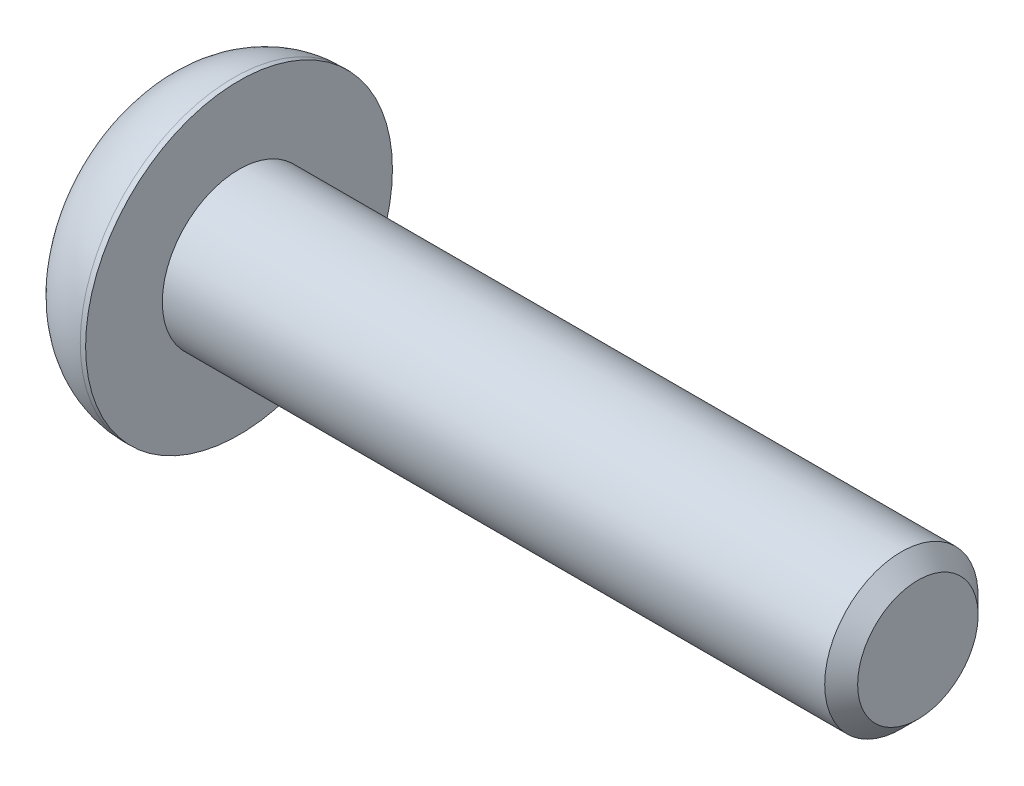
ISO-10303-21;
HEADER;
FILE_DESCRIPTION(('STEP AP214'),'2;1');
FILE_NAME('part.step','',(''),(''),'','','');
FILE_SCHEMA(('AUTOMOTIVE_DESIGN { 1 0 10303 214 1 1 1 1 }'));
ENDSEC;
DATA;
#1=APPLICATION_CONTEXT('core data for automotive mechanical design processes');
#2=APPLICATION_PROTOCOL_DEFINITION('international standard','automotive_design',2000,#1);
#3=PRODUCT_CONTEXT('',#1,'mechanical');
#4=PRODUCT('Part','Part','',(#3));
#5=PRODUCT_RELATED_PRODUCT_CATEGORY('part','',(#4));
#6=PRODUCT_DEFINITION_FORMATION('','',#4);
#7=PRODUCT_DEFINITION_CONTEXT('part definition',#1,'design');
#8=PRODUCT_DEFINITION('design','',#6,#7);
#9=PRODUCT_DEFINITION_SHAPE('','',#8);
#10=(LENGTH_UNIT() NAMED_UNIT(*) SI_UNIT(.MILLI.,.METRE.));
#11=(NAMED_UNIT(*) PLANE_ANGLE_UNIT() SI_UNIT($,.RADIAN.));
#12=(NAMED_UNIT(*) SI_UNIT($,.STERADIAN.) SOLID_ANGLE_UNIT());
#13=UNCERTAINTY_MEASURE_WITH_UNIT(LENGTH_MEASURE(1.E-05),#10,'distance_accuracy_value','');
#14=(GEOMETRIC_REPRESENTATION_CONTEXT(3) GLOBAL_UNCERTAINTY_ASSIGNED_CONTEXT((#13)) GLOBAL_UNIT_ASSIGNED_CONTEXT((#10,
#11,#12)) REPRESENTATION_CONTEXT('',''));
#15=CARTESIAN_POINT('',(0.,0.,0.));
#16=DIRECTION('',(0.,0.,1.));
#17=DIRECTION('',(1.,0.,0.));
#18=AXIS2_PLACEMENT_3D('',#15,#16,#17);
#19=CARTESIAN_POINT('',(1.495,0.721687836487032,1.25));
#20=DIRECTION('',(1.,0.,0.));
#21=DIRECTION('',(0.,0.,-1.));
#22=AXIS2_PLACEMENT_3D('',#19,#20,#21);
#23=PLANE('',#22);
#24=CARTESIAN_POINT('',(1.495,0.,0.));
#25=DIRECTION('',(1.,0.,0.));
#26=DIRECTION('',(0.,0.,-1.));
#27=AXIS2_PLACEMENT_3D('',#24,#25,#26);
#28=CIRCLE('',#27,1.25);
#29=CARTESIAN_POINT('',(1.495,0.,-1.25));
#30=VERTEX_POINT('',#29);
#31=CARTESIAN_POINT('',(1.495,-1.08253175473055,-0.625));
#32=VERTEX_POINT('',#31);
#33=EDGE_CURVE('E11',#30,#32,#28,.F.);
#34=ORIENTED_EDGE('',*,*,#33,.F.);
#35=DIRECTION('',(0.,1.,0.));
#36=VECTOR('',#35,1.);
#37=CARTESIAN_POINT('',(1.495,-0.721687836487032,-1.25));
#38=LINE('',#37,#36);
#39=CARTESIAN_POINT('',(1.495,-0.721687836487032,-1.25));
#40=VERTEX_POINT('',#39);
#41=EDGE_CURVE('E155',#40,#30,#38,.T.);
#42=ORIENTED_EDGE('',*,*,#41,.F.);
#43=DIRECTION('',(0.,0.5,-0.866025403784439));
#44=VECTOR('',#43,1.);
#45=CARTESIAN_POINT('',(1.495,-1.44337567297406,0.));
#46=LINE('',#45,#44);
#47=EDGE_CURVE('E407',#32,#40,#46,.T.);
#48=ORIENTED_EDGE('',*,*,#47,.F.);
#49=EDGE_LOOP('',(#34,#42,#48));
#50=FACE_BOUND('',#49,.T.);
#51=ADVANCED_FACE('F32',(#50),#23,.F.);
#52=CARTESIAN_POINT('',(1.495,-1.08253175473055,0.625));
#53=VERTEX_POINT('',#52);
#54=EDGE_CURVE('E41',#32,#53,#28,.F.);
#55=ORIENTED_EDGE('',*,*,#54,.F.);
#56=CARTESIAN_POINT('',(1.495,-1.44337567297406,0.));
#57=VERTEX_POINT('',#56);
#58=EDGE_CURVE('E408',#57,#32,#46,.T.);
#59=ORIENTED_EDGE('',*,*,#58,.F.);
#60=DIRECTION('',(0.,-0.5,-0.866025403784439));
#61=VECTOR('',#60,1.);
#62=CARTESIAN_POINT('',(1.495,-0.721687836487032,1.25));
#63=LINE('',#62,#61);
#64=EDGE_CURVE('E403',#53,#57,#63,.T.);
#65=ORIENTED_EDGE('',*,*,#64,.F.);
#66=EDGE_LOOP('',(#55,#59,#65));
#67=FACE_BOUND('',#66,.T.);
#68=ADVANCED_FACE('F117',(#67),#23,.F.);
#69=CARTESIAN_POINT('',(1.495,0.,1.25));
#70=VERTEX_POINT('',#69);
#71=EDGE_CURVE('E393',#53,#70,#28,.F.);
#72=ORIENTED_EDGE('',*,*,#71,.F.);
#73=CARTESIAN_POINT('',(1.495,-0.721687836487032,1.25));
#74=VERTEX_POINT('',#73);
#75=EDGE_CURVE('E399',#74,#53,#63,.T.);
#76=ORIENTED_EDGE('',*,*,#75,.F.);
#77=DIRECTION('',(0.,-1.,0.));
#78=VECTOR('',#77,1.);
#79=CARTESIAN_POINT('',(1.495,0.721687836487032,1.25));
#80=LINE('',#79,#78);
#81=EDGE_CURVE('E396',#70,#74,#80,.T.);
#82=ORIENTED_EDGE('',*,*,#81,.F.);
#83=EDGE_LOOP('',(#72,#76,#82));
#84=FACE_BOUND('',#83,.T.);
#85=ADVANCED_FACE('F124',(#84),#23,.F.);
#86=CARTESIAN_POINT('',(1.495,1.08253175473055,0.625));
#87=VERTEX_POINT('',#86);
#88=EDGE_CURVE('E388',#70,#87,#28,.F.);
#89=ORIENTED_EDGE('',*,*,#88,.F.);
#90=CARTESIAN_POINT('',(1.495,0.721687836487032,1.25));
#91=VERTEX_POINT('',#90);
#92=EDGE_CURVE('E391',#91,#70,#80,.T.);
#93=ORIENTED_EDGE('',*,*,#92,.F.);
#94=DIRECTION('',(0.,-0.5,0.866025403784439));
#95=VECTOR('',#94,1.);
#96=CARTESIAN_POINT('',(1.495,1.44337567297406,0.));
#97=LINE('',#96,#95);
#98=EDGE_CURVE('E176',#87,#91,#97,.T.);
#99=ORIENTED_EDGE('',*,*,#98,.F.);
#100=EDGE_LOOP('',(#89,#93,#99));
#101=FACE_BOUND('',#100,.T.);
#102=ADVANCED_FACE('F137',(#101),#23,.F.);
#103=CARTESIAN_POINT('',(1.495,1.08253175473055,-0.625));
#104=VERTEX_POINT('',#103);
#105=EDGE_CURVE('E48',#87,#104,#28,.F.);
#106=ORIENTED_EDGE('',*,*,#105,.F.);
#107=CARTESIAN_POINT('',(1.495,1.44337567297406,0.));
#108=VERTEX_POINT('',#107);
#109=EDGE_CURVE('E151',#108,#87,#97,.T.);
#110=ORIENTED_EDGE('',*,*,#109,.F.);
#111=DIRECTION('',(0.,0.5,0.866025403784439));
#112=VECTOR('',#111,1.);
#113=CARTESIAN_POINT('',(1.495,0.721687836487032,-1.25));
#114=LINE('',#113,#112);
#115=EDGE_CURVE('E148',#104,#108,#114,.T.);
#116=ORIENTED_EDGE('',*,*,#115,.F.);
#117=EDGE_LOOP('',(#106,#110,#116));
#118=FACE_BOUND('',#117,.T.);
#119=ADVANCED_FACE('F129',(#118),#23,.F.);
#120=EDGE_CURVE('E36',#104,#30,#28,.F.);
#121=ORIENTED_EDGE('',*,*,#120,.F.);
#122=CARTESIAN_POINT('',(1.495,0.721687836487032,-1.25));
#123=VERTEX_POINT('',#122);
#124=EDGE_CURVE('E143',#123,#104,#114,.T.);
#125=ORIENTED_EDGE('',*,*,#124,.F.);
#126=EDGE_CURVE('E144',#30,#123,#38,.T.);
#127=ORIENTED_EDGE('',*,*,#126,.F.);
#128=EDGE_LOOP('',(#121,#125,#127));
#129=FACE_BOUND('',#128,.T.);
#130=ADVANCED_FACE('F120',(#129),#23,.F.);
#131=CARTESIAN_POINT('',(0.,0.,0.));
#132=DIRECTION('',(1.,0.,0.));
#133=DIRECTION('',(0.,0.,-1.));
#134=AXIS2_PLACEMENT_3D('',#131,#132,#133);
#135=PLANE('',#134);
#136=CARTESIAN_POINT('',(0.,0.,0.));
#137=DIRECTION('',(-1.,0.,0.));
#138=DIRECTION('',(0.,0.,1.));
#139=AXIS2_PLACEMENT_3D('',#136,#137,#138);
#140=CIRCLE('',#139,1.84);
#141=CARTESIAN_POINT('',(0.,0.,1.84));
#142=VERTEX_POINT('',#141);
#143=EDGE_CURVE('E146',#142,#142,#140,.T.);
#144=ORIENTED_EDGE('',*,*,#143,.T.);
#145=EDGE_LOOP('',(#144));
#146=FACE_BOUND('',#145,.T.);
#147=DIRECTION('',(0.,-0.5,0.866025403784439));
#148=VECTOR('',#147,1.);
#149=CARTESIAN_POINT('',(0.,1.44337567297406,0.));
#150=LINE('',#149,#148);
#151=CARTESIAN_POINT('',(0.,1.44337567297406,0.));
#152=VERTEX_POINT('',#151);
#153=CARTESIAN_POINT('',(0.,0.721687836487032,1.25));
#154=VERTEX_POINT('',#153);
#155=EDGE_CURVE('E165',#152,#154,#150,.T.);
#156=ORIENTED_EDGE('',*,*,#155,.T.);
#157=DIRECTION('',(0.,-1.,0.));
#158=VECTOR('',#157,1.);
#159=CARTESIAN_POINT('',(0.,0.721687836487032,1.25));
#160=LINE('',#159,#158);
#161=CARTESIAN_POINT('',(0.,-0.721687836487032,1.25));
#162=VERTEX_POINT('',#161);
#163=EDGE_CURVE('E167',#154,#162,#160,.T.);
#164=ORIENTED_EDGE('',*,*,#163,.T.);
#165=DIRECTION('',(0.,-0.5,-0.866025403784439));
#166=VECTOR('',#165,1.);
#167=CARTESIAN_POINT('',(0.,-0.721687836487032,1.25));
#168=LINE('',#167,#166);
#169=CARTESIAN_POINT('',(0.,-1.44337567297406,0.));
#170=VERTEX_POINT('',#169);
#171=EDGE_CURVE('E170',#162,#170,#168,.T.);
#172=ORIENTED_EDGE('',*,*,#171,.T.);
#173=DIRECTION('',(0.,0.5,-0.866025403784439));
#174=VECTOR('',#173,1.);
#175=CARTESIAN_POINT('',(0.,-1.44337567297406,0.));
#176=LINE('',#175,#174);
#177=CARTESIAN_POINT('',(0.,-0.721687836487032,-1.25));
#178=VERTEX_POINT('',#177);
#179=EDGE_CURVE('E172',#170,#178,#176,.T.);
#180=ORIENTED_EDGE('',*,*,#179,.T.);
#181=DIRECTION('',(0.,1.,0.));
#182=VECTOR('',#181,1.);
#183=CARTESIAN_POINT('',(0.,-0.721687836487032,-1.25));
#184=LINE('',#183,#182);
#185=CARTESIAN_POINT('',(0.,0.721687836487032,-1.25));
#186=VERTEX_POINT('',#185);
#187=EDGE_CURVE('E174',#178,#186,#184,.T.);
#188=ORIENTED_EDGE('',*,*,#187,.T.);
#189=DIRECTION('',(0.,0.5,0.866025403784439));
#190=VECTOR('',#189,1.);
#191=CARTESIAN_POINT('',(0.,0.721687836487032,-1.25));
#192=LINE('',#191,#190);
#193=EDGE_CURVE('E56',#186,#152,#192,.T.);
#194=ORIENTED_EDGE('',*,*,#193,.T.);
#195=EDGE_LOOP('',(#156,#164,#172,#180,#188,#194));
#196=FACE_BOUND('',#195,.T.);
#197=ADVANCED_FACE('F34',(#146,#196),#135,.F.);
#198=CARTESIAN_POINT('',(2.16,0.,0.));
#199=DIRECTION('',(-1.,0.,0.));
#200=DIRECTION('',(0.,0.,1.));
#201=AXIS2_PLACEMENT_3D('',#198,#199,#200);
#202=DEGENERATE_TOROIDAL_SURFACE('',#201,1.84,2.16,.T.);
#203=ORIENTED_EDGE('',*,*,#143,.F.);
#204=EDGE_LOOP('',(#203));
#205=FACE_BOUND('',#204,.T.);
#206=CARTESIAN_POINT('',(2.16,0.,0.));
#207=DIRECTION('',(-1.,0.,0.));
#208=DIRECTION('',(0.,0.,1.));
#209=AXIS2_PLACEMENT_3D('',#206,#207,#208);
#210=CIRCLE('',#209,4.);
#211=CARTESIAN_POINT('',(2.16,0.,4.));
#212=VERTEX_POINT('',#211);
#213=EDGE_CURVE('E203',#212,#212,#210,.T.);
#214=ORIENTED_EDGE('',*,*,#213,.T.);
#215=EDGE_LOOP('',(#214));
#216=FACE_BOUND('',#215,.T.);
#217=ADVANCED_FACE('F135',(#205,#216),#202,.T.);
#218=CARTESIAN_POINT('',(20.,0.,0.));
#219=DIRECTION('',(-1.,0.,0.));
#220=DIRECTION('',(0.,0.,1.));
#221=AXIS2_PLACEMENT_3D('',#218,#219,#220);
#222=CYLINDRICAL_SURFACE('',#221,4.);
#223=ORIENTED_EDGE('',*,*,#213,.F.);
#224=EDGE_LOOP('',(#223));
#225=FACE_BOUND('',#224,.T.);
#226=CARTESIAN_POINT('',(2.3,0.,0.));
#227=DIRECTION('',(-1.,0.,0.));
#228=DIRECTION('',(0.,0.,1.));
#229=AXIS2_PLACEMENT_3D('',#226,#227,#228);
#230=CIRCLE('',#229,4.);
#231=CARTESIAN_POINT('',(2.3,0.,4.));
#232=VERTEX_POINT('',#231);
#233=EDGE_CURVE('E200',#232,#232,#230,.T.);
#234=ORIENTED_EDGE('',*,*,#233,.T.);
#235=EDGE_LOOP('',(#234));
#236=FACE_BOUND('',#235,.T.);
#237=ADVANCED_FACE('F210',(#225,#236),#222,.T.);
#238=CARTESIAN_POINT('',(2.3,4.,0.));
#239=DIRECTION('',(-1.,0.,0.));
#240=DIRECTION('',(0.,0.,1.));
#241=AXIS2_PLACEMENT_3D('',#238,#239,#240);
#242=PLANE('',#241);
#243=ORIENTED_EDGE('',*,*,#233,.F.);
#244=EDGE_LOOP('',(#243));
#245=FACE_BOUND('',#244,.T.);
#246=CARTESIAN_POINT('',(2.3,0.,0.));
#247=DIRECTION('',(-1.,0.,0.));
#248=DIRECTION('',(0.,0.,1.));
#249=AXIS2_PLACEMENT_3D('',#246,#247,#248);
#250=CIRCLE('',#249,2.);
#251=CARTESIAN_POINT('',(2.3,0.,2.));
#252=VERTEX_POINT('',#251);
#253=EDGE_CURVE('E197',#252,#252,#250,.T.);
#254=ORIENTED_EDGE('',*,*,#253,.T.);
#255=EDGE_LOOP('',(#254));
#256=FACE_BOUND('',#255,.T.);
#257=ADVANCED_FACE('F215',(#245,#256),#242,.F.);
#258=CARTESIAN_POINT('',(20.,0.,0.));
#259=DIRECTION('',(-1.,0.,0.));
#260=DIRECTION('',(0.,0.,1.));
#261=AXIS2_PLACEMENT_3D('',#258,#259,#260);
#262=CYLINDRICAL_SURFACE('',#261,2.);
#263=ORIENTED_EDGE('',*,*,#253,.F.);
#264=EDGE_LOOP('',(#263));
#265=FACE_BOUND('',#264,.T.);
#266=CARTESIAN_POINT('',(19.5705,0.,0.));
#267=DIRECTION('',(-1.,0.,0.));
#268=DIRECTION('',(0.,0.,1.));
#269=AXIS2_PLACEMENT_3D('',#266,#267,#268);
#270=CIRCLE('',#269,2.);
#271=CARTESIAN_POINT('',(19.5705,0.,2.));
#272=VERTEX_POINT('',#271);
#273=EDGE_CURVE('E194',#272,#272,#270,.T.);
#274=ORIENTED_EDGE('',*,*,#273,.T.);
#275=EDGE_LOOP('',(#274));
#276=FACE_BOUND('',#275,.T.);
#277=ADVANCED_FACE('F221',(#265,#276),#262,.T.);
#278=CARTESIAN_POINT('',(20.,0.,0.));
#279=DIRECTION('',(-1.,0.,0.));
#280=DIRECTION('',(0.,0.,1.));
#281=AXIS2_PLACEMENT_3D('',#278,#279,#280);
#282=CONICAL_SURFACE('',#281,1.5705,0.785398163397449);
#283=ORIENTED_EDGE('',*,*,#273,.F.);
#284=EDGE_LOOP('',(#283));
#285=FACE_BOUND('',#284,.T.);
#286=CARTESIAN_POINT('',(20.,0.,0.));
#287=DIRECTION('',(-1.,0.,0.));
#288=DIRECTION('',(0.,0.,1.));
#289=AXIS2_PLACEMENT_3D('',#286,#287,#288);
#290=CIRCLE('',#289,1.5705);
#291=CARTESIAN_POINT('',(20.,0.,1.5705));
#292=VERTEX_POINT('',#291);
#293=EDGE_CURVE('E191',#292,#292,#290,.T.);
#294=ORIENTED_EDGE('',*,*,#293,.T.);
#295=EDGE_LOOP('',(#294));
#296=FACE_BOUND('',#295,.T.);
#297=ADVANCED_FACE('F227',(#285,#296),#282,.T.);
#298=CARTESIAN_POINT('',(20.,1.5705,0.));
#299=DIRECTION('',(-1.,0.,0.));
#300=DIRECTION('',(0.,0.,1.));
#301=AXIS2_PLACEMENT_3D('',#298,#299,#300);
#302=PLANE('',#301);
#303=ORIENTED_EDGE('',*,*,#293,.F.);
#304=EDGE_LOOP('',(#303));
#305=FACE_BOUND('',#304,.T.);
#306=ADVANCED_FACE('F233',(#305),#302,.F.);
#307=CARTESIAN_POINT('',(1.495,1.44337567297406,0.));
#308=DIRECTION('',(0.,-0.866025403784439,-0.5));
#309=DIRECTION('',(0.,0.5,-0.866025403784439));
#310=AXIS2_PLACEMENT_3D('',#307,#308,#309);
#311=PLANE('',#310);
#312=ORIENTED_EDGE('',*,*,#109,.T.);
#313=ORIENTED_EDGE('',*,*,#98,.T.);
#314=DIRECTION('',(-1.,0.,0.));
#315=VECTOR('',#314,1.);
#316=CARTESIAN_POINT('',(1.495,0.721687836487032,1.25));
#317=LINE('',#316,#315);
#318=EDGE_CURVE('E188',#91,#154,#317,.T.);
#319=ORIENTED_EDGE('',*,*,#318,.T.);
#320=ORIENTED_EDGE('',*,*,#155,.F.);
#321=DIRECTION('',(-1.,0.,0.));
#322=VECTOR('',#321,1.);
#323=CARTESIAN_POINT('',(1.495,1.44337567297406,0.));
#324=LINE('',#323,#322);
#325=EDGE_CURVE('E160',#108,#152,#324,.T.);
#326=ORIENTED_EDGE('',*,*,#325,.F.);
#327=EDGE_LOOP('',(#312,#313,#319,#320,#326));
#328=FACE_BOUND('',#327,.T.);
#329=ADVANCED_FACE('F238',(#328),#311,.T.);
#330=CARTESIAN_POINT('',(1.495,0.721687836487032,1.25));
#331=DIRECTION('',(0.,0.,-1.));
#332=DIRECTION('',(-1.,0.,0.));
#333=AXIS2_PLACEMENT_3D('',#330,#331,#332);
#334=PLANE('',#333);
#335=ORIENTED_EDGE('',*,*,#92,.T.);
#336=ORIENTED_EDGE('',*,*,#81,.T.);
#337=DIRECTION('',(-1.,0.,0.));
#338=VECTOR('',#337,1.);
#339=CARTESIAN_POINT('',(1.495,-0.721687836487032,1.25));
#340=LINE('',#339,#338);
#341=EDGE_CURVE('E185',#74,#162,#340,.T.);
#342=ORIENTED_EDGE('',*,*,#341,.T.);
#343=ORIENTED_EDGE('',*,*,#163,.F.);
#344=ORIENTED_EDGE('',*,*,#318,.F.);
#345=EDGE_LOOP('',(#335,#336,#342,#343,#344));
#346=FACE_BOUND('',#345,.T.);
#347=ADVANCED_FACE('F243',(#346),#334,.T.);
#348=CARTESIAN_POINT('',(1.495,-0.721687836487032,1.25));
#349=DIRECTION('',(0.,0.866025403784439,-0.5));
#350=DIRECTION('',(0.,0.5,0.866025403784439));
#351=AXIS2_PLACEMENT_3D('',#348,#349,#350);
#352=PLANE('',#351);
#353=ORIENTED_EDGE('',*,*,#75,.T.);
#354=ORIENTED_EDGE('',*,*,#64,.T.);
#355=DIRECTION('',(-1.,0.,0.));
#356=VECTOR('',#355,1.);
#357=CARTESIAN_POINT('',(1.495,-1.44337567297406,0.));
#358=LINE('',#357,#356);
#359=EDGE_CURVE('E182',#57,#170,#358,.T.);
#360=ORIENTED_EDGE('',*,*,#359,.T.);
#361=ORIENTED_EDGE('',*,*,#171,.F.);
#362=ORIENTED_EDGE('',*,*,#341,.F.);
#363=EDGE_LOOP('',(#353,#354,#360,#361,#362));
#364=FACE_BOUND('',#363,.T.);
#365=ADVANCED_FACE('F249',(#364),#352,.T.);
#366=CARTESIAN_POINT('',(1.495,-1.44337567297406,0.));
#367=DIRECTION('',(0.,0.866025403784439,0.5));
#368=DIRECTION('',(0.,-0.5,0.866025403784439));
#369=AXIS2_PLACEMENT_3D('',#366,#367,#368);
#370=PLANE('',#369);
#371=ORIENTED_EDGE('',*,*,#58,.T.);
#372=ORIENTED_EDGE('',*,*,#47,.T.);
#373=DIRECTION('',(-1.,0.,0.));
#374=VECTOR('',#373,1.);
#375=CARTESIAN_POINT('',(1.495,-0.721687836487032,-1.25));
#376=LINE('',#375,#374);
#377=EDGE_CURVE('E179',#40,#178,#376,.T.);
#378=ORIENTED_EDGE('',*,*,#377,.T.);
#379=ORIENTED_EDGE('',*,*,#179,.F.);
#380=ORIENTED_EDGE('',*,*,#359,.F.);
#381=EDGE_LOOP('',(#371,#372,#378,#379,#380));
#382=FACE_BOUND('',#381,.T.);
#383=ADVANCED_FACE('F253',(#382),#370,.T.);
#384=CARTESIAN_POINT('',(1.495,-0.721687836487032,-1.25));
#385=DIRECTION('',(0.,0.,1.));
#386=DIRECTION('',(1.,0.,0.));
#387=AXIS2_PLACEMENT_3D('',#384,#385,#386);
#388=PLANE('',#387);
#389=ORIENTED_EDGE('',*,*,#41,.T.);
#390=ORIENTED_EDGE('',*,*,#126,.T.);
#391=DIRECTION('',(-1.,0.,0.));
#392=VECTOR('',#391,1.);
#393=CARTESIAN_POINT('',(1.495,0.721687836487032,-1.25));
#394=LINE('',#393,#392);
#395=EDGE_CURVE('E159',#123,#186,#394,.T.);
#396=ORIENTED_EDGE('',*,*,#395,.T.);
#397=ORIENTED_EDGE('',*,*,#187,.F.);
#398=ORIENTED_EDGE('',*,*,#377,.F.);
#399=EDGE_LOOP('',(#389,#390,#396,#397,#398));
#400=FACE_BOUND('',#399,.T.);
#401=ADVANCED_FACE('F257',(#400),#388,.T.);
#402=CARTESIAN_POINT('',(1.495,0.721687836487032,-1.25));
#403=DIRECTION('',(0.,-0.866025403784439,0.5));
#404=DIRECTION('',(0.,-0.5,-0.866025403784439));
#405=AXIS2_PLACEMENT_3D('',#402,#403,#404);
#406=PLANE('',#405);
#407=ORIENTED_EDGE('',*,*,#124,.T.);
#408=ORIENTED_EDGE('',*,*,#115,.T.);
#409=ORIENTED_EDGE('',*,*,#325,.T.);
#410=ORIENTED_EDGE('',*,*,#193,.F.);
#411=ORIENTED_EDGE('',*,*,#395,.F.);
#412=EDGE_LOOP('',(#407,#408,#409,#410,#411));
#413=FACE_BOUND('',#412,.T.);
#414=ADVANCED_FACE('F112',(#413),#406,.T.);
#415=CARTESIAN_POINT('',(2.3,0.,0.));
#416=DIRECTION('',(-1.,0.,0.));
#417=DIRECTION('',(0.,0.,1.));
#418=AXIS2_PLACEMENT_3D('',#415,#416,#417);
#419=CYLINDRICAL_SURFACE('',#418,1.25);
#420=CARTESIAN_POINT('',(1.57831216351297,0.,0.));
#421=DIRECTION('',(-1.,0.,0.));
#422=DIRECTION('',(0.,0.,1.));
#423=AXIS2_PLACEMENT_3D('',#420,#421,#422);
#424=CIRCLE('',#423,1.25);
#425=CARTESIAN_POINT('',(1.57831216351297,0.,1.25));
#426=VERTEX_POINT('',#425);
#427=EDGE_CURVE('E168',#426,#426,#424,.T.);
#428=ORIENTED_EDGE('',*,*,#427,.F.);
#429=EDGE_LOOP('',(#428));
#430=FACE_BOUND('',#429,.T.);
#431=ORIENTED_EDGE('',*,*,#33,.T.);
#432=ORIENTED_EDGE('',*,*,#54,.T.);
#433=ORIENTED_EDGE('',*,*,#71,.T.);
#434=ORIENTED_EDGE('',*,*,#88,.T.);
#435=ORIENTED_EDGE('',*,*,#105,.T.);
#436=ORIENTED_EDGE('',*,*,#120,.T.);
#437=EDGE_LOOP('',(#431,#432,#433,#434,#435,#436));
#438=FACE_BOUND('',#437,.T.);
#439=ADVANCED_FACE('F106',(#430,#438),#419,.F.);
#440=CARTESIAN_POINT('',(2.3,0.,0.));
#441=DIRECTION('',(-1.,0.,0.));
#442=DIRECTION('',(0.,0.,1.));
#443=AXIS2_PLACEMENT_3D('',#440,#441,#442);
#444=CONICAL_SURFACE('',#443,0.,1.0471975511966);
#445=ORIENTED_EDGE('',*,*,#427,.T.);
#446=EDGE_LOOP('',(#445));
#447=FACE_BOUND('',#446,.T.);
#448=CARTESIAN_POINT('',(2.3,0.,0.));
#449=VERTEX_POINT('',#448);
#450=VERTEX_LOOP('',#449);
#451=FACE_BOUND('',#450,.T.);
#452=ADVANCED_FACE('F104',(#447,#451),#444,.F.);
#453=CLOSED_SHELL('',(#51,#68,#85,#102,#119,#130,#197,#217,#237,#257,#277,#297,#306,#329,#347,
#365,#383,#401,#414,#439,#452));
#454=MANIFOLD_SOLID_BREP('B2',#453);
#455=ADVANCED_BREP_SHAPE_REPRESENTATION('',(#18,#454),#14);
#456=SHAPE_DEFINITION_REPRESENTATION(#9,#455);
ENDSEC;
END-ISO-10303-21;
